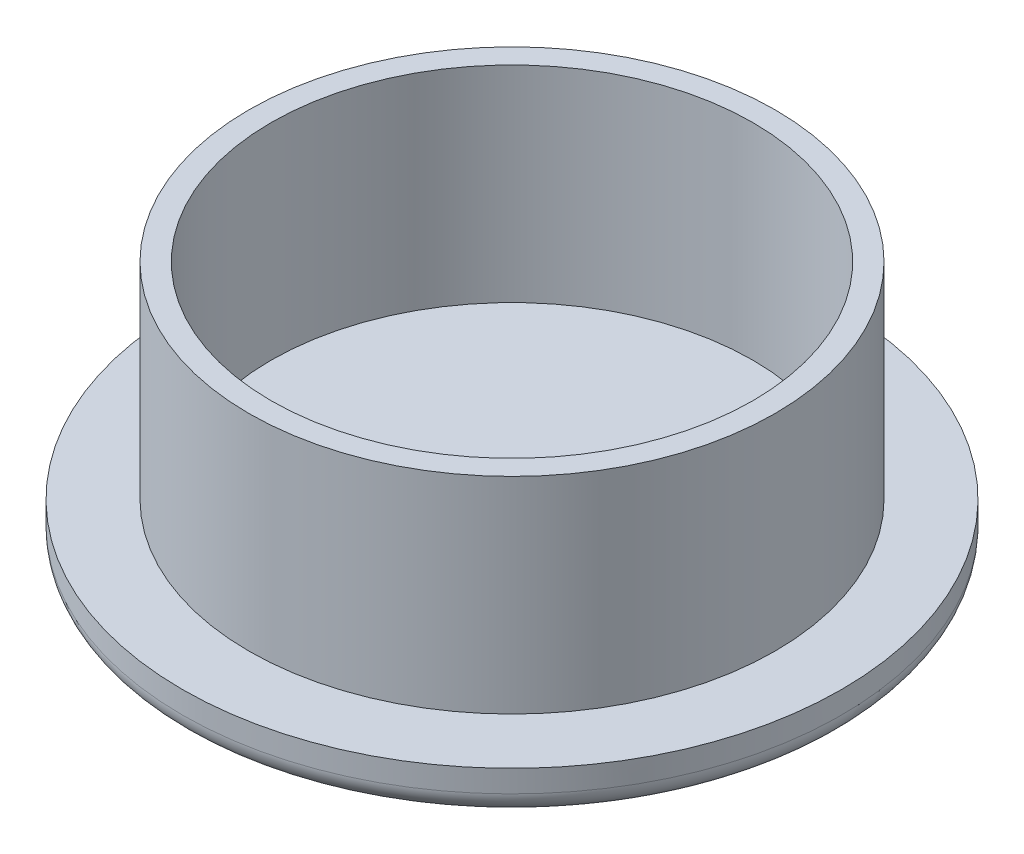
ISO-10303-21;
HEADER;
FILE_DESCRIPTION(('STEP AP214'),'2;1');
FILE_NAME('part.step','',(''),(''),'','','');
FILE_SCHEMA(('AUTOMOTIVE_DESIGN { 1 0 10303 214 1 1 1 1 }'));
ENDSEC;
DATA;
#1=APPLICATION_CONTEXT('core data for automotive mechanical design processes');
#2=APPLICATION_PROTOCOL_DEFINITION('international standard','automotive_design',2000,#1);
#3=PRODUCT_CONTEXT('',#1,'mechanical');
#4=PRODUCT('Part','Part','',(#3));
#5=PRODUCT_RELATED_PRODUCT_CATEGORY('part','',(#4));
#6=PRODUCT_DEFINITION_FORMATION('','',#4);
#7=PRODUCT_DEFINITION_CONTEXT('part definition',#1,'design');
#8=PRODUCT_DEFINITION('design','',#6,#7);
#9=PRODUCT_DEFINITION_SHAPE('','',#8);
#10=(LENGTH_UNIT() NAMED_UNIT(*) SI_UNIT(.MILLI.,.METRE.));
#11=(NAMED_UNIT(*) PLANE_ANGLE_UNIT() SI_UNIT($,.RADIAN.));
#12=(NAMED_UNIT(*) SI_UNIT($,.STERADIAN.) SOLID_ANGLE_UNIT());
#13=UNCERTAINTY_MEASURE_WITH_UNIT(LENGTH_MEASURE(1.E-05),#10,'distance_accuracy_value','');
#14=(GEOMETRIC_REPRESENTATION_CONTEXT(3) GLOBAL_UNCERTAINTY_ASSIGNED_CONTEXT((#13)) GLOBAL_UNIT_ASSIGNED_CONTEXT((#10,
#11,#12)) REPRESENTATION_CONTEXT('',''));
#15=CARTESIAN_POINT('',(0.,0.,0.));
#16=DIRECTION('',(0.,0.,1.));
#17=DIRECTION('',(1.,0.,0.));
#18=AXIS2_PLACEMENT_3D('',#15,#16,#17);
#19=CARTESIAN_POINT('',(0.,0.,0.));
#20=DIRECTION('',(0.,1.,0.));
#21=DIRECTION('',(0.,0.,1.));
#22=AXIS2_PLACEMENT_3D('',#19,#20,#21);
#23=PLANE('',#22);
#24=CARTESIAN_POINT('',(0.,0.,0.));
#25=DIRECTION('',(0.,1.,0.));
#26=DIRECTION('',(1.,0.,0.));
#27=AXIS2_PLACEMENT_3D('',#24,#25,#26);
#28=CIRCLE('',#27,29.75);
#29=CARTESIAN_POINT('',(29.75,0.,0.));
#30=VERTEX_POINT('',#29);
#31=EDGE_CURVE('E28',#30,#30,#28,.T.);
#32=ORIENTED_EDGE('',*,*,#31,.T.);
#33=EDGE_LOOP('',(#32));
#34=FACE_BOUND('',#33,.T.);
#35=CARTESIAN_POINT('',(0.,0.,0.));
#36=DIRECTION('',(0.,1.,0.));
#37=DIRECTION('',(1.,0.,0.));
#38=AXIS2_PLACEMENT_3D('',#35,#36,#37);
#39=CIRCLE('',#38,23.75);
#40=CARTESIAN_POINT('',(23.75,0.,0.));
#41=VERTEX_POINT('',#40);
#42=EDGE_CURVE('E40',#41,#41,#39,.T.);
#43=ORIENTED_EDGE('',*,*,#42,.F.);
#44=EDGE_LOOP('',(#43));
#45=FACE_BOUND('',#44,.T.);
#46=ADVANCED_FACE('F12',(#34,#45),#23,.T.);
#47=CARTESIAN_POINT('',(0.,-4.,0.));
#48=DIRECTION('',(0.,1.,0.));
#49=DIRECTION('',(0.,0.,1.));
#50=AXIS2_PLACEMENT_3D('',#47,#48,#49);
#51=CYLINDRICAL_SURFACE('',#50,29.75);
#52=CARTESIAN_POINT('',(0.,-2.,0.));
#53=DIRECTION('',(0.,1.,0.));
#54=DIRECTION('',(0.,0.,1.));
#55=AXIS2_PLACEMENT_3D('',#52,#53,#54);
#56=CIRCLE('',#55,29.75);
#57=CARTESIAN_POINT('',(0.,-2.,29.75));
#58=VERTEX_POINT('',#57);
#59=EDGE_CURVE('E19',#58,#58,#56,.T.);
#60=ORIENTED_EDGE('',*,*,#59,.T.);
#61=EDGE_LOOP('',(#60));
#62=FACE_BOUND('',#61,.T.);
#63=ORIENTED_EDGE('',*,*,#31,.F.);
#64=EDGE_LOOP('',(#63));
#65=FACE_BOUND('',#64,.T.);
#66=ADVANCED_FACE('F14',(#62,#65),#51,.T.);
#67=CARTESIAN_POINT('',(0.,-4.,0.));
#68=DIRECTION('',(0.,1.,0.));
#69=DIRECTION('',(0.,0.,1.));
#70=AXIS2_PLACEMENT_3D('',#67,#68,#69);
#71=PLANE('',#70);
#72=CARTESIAN_POINT('',(0.,-4.,0.));
#73=DIRECTION('',(0.,1.,0.));
#74=DIRECTION('',(0.,0.,1.));
#75=AXIS2_PLACEMENT_3D('',#72,#73,#74);
#76=CIRCLE('',#75,27.75);
#77=CARTESIAN_POINT('',(0.,-4.,27.75));
#78=VERTEX_POINT('',#77);
#79=EDGE_CURVE('E8',#78,#78,#76,.F.);
#80=ORIENTED_EDGE('',*,*,#79,.T.);
#81=EDGE_LOOP('',(#80));
#82=FACE_BOUND('',#81,.T.);
#83=ADVANCED_FACE('F57',(#82),#71,.F.);
#84=CARTESIAN_POINT('',(0.,18.58,0.));
#85=DIRECTION('',(0.,-1.,0.));
#86=DIRECTION('',(0.,0.,-1.));
#87=AXIS2_PLACEMENT_3D('',#84,#85,#86);
#88=CYLINDRICAL_SURFACE('',#87,21.75);
#89=CARTESIAN_POINT('',(0.,18.58,0.));
#90=DIRECTION('',(0.,1.,0.));
#91=DIRECTION('',(1.,0.,0.));
#92=AXIS2_PLACEMENT_3D('',#89,#90,#91);
#93=CIRCLE('',#92,21.75);
#94=CARTESIAN_POINT('',(21.75,18.58,0.));
#95=VERTEX_POINT('',#94);
#96=EDGE_CURVE('E34',#95,#95,#93,.T.);
#97=ORIENTED_EDGE('',*,*,#96,.T.);
#98=EDGE_LOOP('',(#97));
#99=FACE_BOUND('',#98,.T.);
#100=CARTESIAN_POINT('',(0.,0.,0.));
#101=DIRECTION('',(0.,1.,0.));
#102=DIRECTION('',(0.,0.,1.));
#103=AXIS2_PLACEMENT_3D('',#100,#101,#102);
#104=CIRCLE('',#103,21.75);
#105=CARTESIAN_POINT('',(0.,0.,21.75));
#106=VERTEX_POINT('',#105);
#107=EDGE_CURVE('E23',#106,#106,#104,.F.);
#108=ORIENTED_EDGE('',*,*,#107,.T.);
#109=EDGE_LOOP('',(#108));
#110=FACE_BOUND('',#109,.T.);
#111=ADVANCED_FACE('F73',(#99,#110),#88,.F.);
#112=CARTESIAN_POINT('',(0.,18.58,0.));
#113=DIRECTION('',(0.,-1.,0.));
#114=DIRECTION('',(0.,0.,-1.));
#115=AXIS2_PLACEMENT_3D('',#112,#113,#114);
#116=CYLINDRICAL_SURFACE('',#115,23.75);
#117=CARTESIAN_POINT('',(0.,18.58,0.));
#118=DIRECTION('',(0.,1.,0.));
#119=DIRECTION('',(1.,0.,0.));
#120=AXIS2_PLACEMENT_3D('',#117,#118,#119);
#121=CIRCLE('',#120,23.75);
#122=CARTESIAN_POINT('',(23.75,18.58,0.));
#123=VERTEX_POINT('',#122);
#124=EDGE_CURVE('E37',#123,#123,#121,.T.);
#125=ORIENTED_EDGE('',*,*,#124,.F.);
#126=EDGE_LOOP('',(#125));
#127=FACE_BOUND('',#126,.T.);
#128=ORIENTED_EDGE('',*,*,#42,.T.);
#129=EDGE_LOOP('',(#128));
#130=FACE_BOUND('',#129,.T.);
#131=ADVANCED_FACE('F47',(#127,#130),#116,.T.);
#132=CARTESIAN_POINT('',(0.,18.58,0.));
#133=DIRECTION('',(0.,1.,0.));
#134=DIRECTION('',(0.,0.,1.));
#135=AXIS2_PLACEMENT_3D('',#132,#133,#134);
#136=PLANE('',#135);
#137=ORIENTED_EDGE('',*,*,#96,.F.);
#138=EDGE_LOOP('',(#137));
#139=FACE_BOUND('',#138,.T.);
#140=ORIENTED_EDGE('',*,*,#124,.T.);
#141=EDGE_LOOP('',(#140));
#142=FACE_BOUND('',#141,.T.);
#143=ADVANCED_FACE('F61',(#139,#142),#136,.T.);
#144=ORIENTED_EDGE('',*,*,#107,.F.);
#145=EDGE_LOOP('',(#144));
#146=FACE_BOUND('',#145,.T.);
#147=ADVANCED_FACE('F52',(#146),#23,.T.);
#148=CARTESIAN_POINT('',(0.,-2.,0.));
#149=DIRECTION('',(0.,1.,0.));
#150=DIRECTION('',(0.,0.,1.));
#151=AXIS2_PLACEMENT_3D('',#148,#149,#150);
#152=TOROIDAL_SURFACE('',#151,27.75,2.);
#153=ORIENTED_EDGE('',*,*,#79,.F.);
#154=EDGE_LOOP('',(#153));
#155=FACE_BOUND('',#154,.T.);
#156=ORIENTED_EDGE('',*,*,#59,.F.);
#157=EDGE_LOOP('',(#156));
#158=FACE_BOUND('',#157,.T.);
#159=ADVANCED_FACE('F60',(#155,#158),#152,.T.);
#160=CLOSED_SHELL('',(#46,#66,#83,#111,#131,#143,#147,#159));
#161=MANIFOLD_SOLID_BREP('B1',#160);
#162=ADVANCED_BREP_SHAPE_REPRESENTATION('',(#18,#161),#14);
#163=SHAPE_DEFINITION_REPRESENTATION(#9,#162);
ENDSEC;
END-ISO-10303-21;
